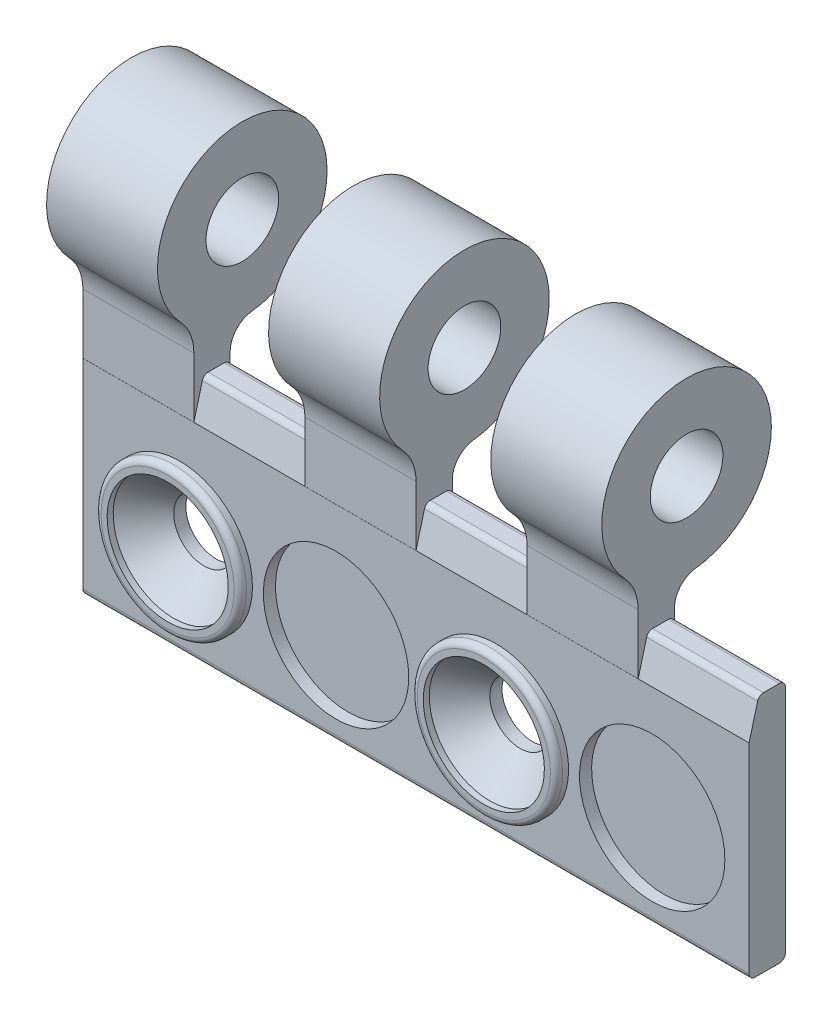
ISO-10303-21;
HEADER;
FILE_DESCRIPTION(('STEP AP214'),'2;1');
FILE_NAME('part.step','',(''),(''),'','','');
FILE_SCHEMA(('AUTOMOTIVE_DESIGN { 1 0 10303 214 1 1 1 1 }'));
ENDSEC;
DATA;
#1=APPLICATION_CONTEXT('core data for automotive mechanical design processes');
#2=APPLICATION_PROTOCOL_DEFINITION('international standard','automotive_design',2000,#1);
#3=PRODUCT_CONTEXT('',#1,'mechanical');
#4=PRODUCT('Part','Part','',(#3));
#5=PRODUCT_RELATED_PRODUCT_CATEGORY('part','',(#4));
#6=PRODUCT_DEFINITION_FORMATION('','',#4);
#7=PRODUCT_DEFINITION_CONTEXT('part definition',#1,'design');
#8=PRODUCT_DEFINITION('design','',#6,#7);
#9=PRODUCT_DEFINITION_SHAPE('','',#8);
#10=(LENGTH_UNIT() NAMED_UNIT(*) SI_UNIT(.MILLI.,.METRE.));
#11=(NAMED_UNIT(*) PLANE_ANGLE_UNIT() SI_UNIT($,.RADIAN.));
#12=(NAMED_UNIT(*) SI_UNIT($,.STERADIAN.) SOLID_ANGLE_UNIT());
#13=UNCERTAINTY_MEASURE_WITH_UNIT(LENGTH_MEASURE(1.E-05),#10,'distance_accuracy_value','');
#14=(GEOMETRIC_REPRESENTATION_CONTEXT(3) GLOBAL_UNCERTAINTY_ASSIGNED_CONTEXT((#13)) GLOBAL_UNIT_ASSIGNED_CONTEXT((#10,
#11,#12)) REPRESENTATION_CONTEXT('',''));
#15=CARTESIAN_POINT('',(0.,0.,0.));
#16=DIRECTION('',(0.,0.,1.));
#17=DIRECTION('',(1.,0.,0.));
#18=AXIS2_PLACEMENT_3D('',#15,#16,#17);
#19=CARTESIAN_POINT('',(-8.,11.85,0.49999999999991));
#20=DIRECTION('',(1.,0.,0.));
#21=DIRECTION('',(0.,1.,0.));
#22=AXIS2_PLACEMENT_3D('',#19,#20,#21);
#23=CYLINDRICAL_SURFACE('',#22,0.499999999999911);
#24=DIRECTION('',(1.,0.,0.));
#25=VECTOR('',#24,1.);
#26=CARTESIAN_POINT('',(-8.,11.85,0.));
#27=LINE('',#26,#25);
#28=CARTESIAN_POINT('',(1.16,11.85,0.));
#29=VERTEX_POINT('',#28);
#30=CARTESIAN_POINT('',(10.33,11.85,0.));
#31=VERTEX_POINT('',#30);
#32=EDGE_CURVE('E493',#29,#31,#27,.T.);
#33=ORIENTED_EDGE('',*,*,#32,.F.);
#34=CARTESIAN_POINT('',(1.16,11.85,0.49999999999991));
#35=DIRECTION('',(-1.,0.,0.));
#36=DIRECTION('',(0.,-1.,0.));
#37=AXIS2_PLACEMENT_3D('',#34,#35,#36);
#38=CIRCLE('',#37,0.499999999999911);
#39=CARTESIAN_POINT('',(1.16,12.35,0.5));
#40=VERTEX_POINT('',#39);
#41=EDGE_CURVE('E262',#29,#40,#38,.F.);
#42=ORIENTED_EDGE('',*,*,#41,.T.);
#43=DIRECTION('',(1.,0.,0.));
#44=VECTOR('',#43,1.);
#45=CARTESIAN_POINT('',(-8.,12.35,0.5));
#46=LINE('',#45,#44);
#47=CARTESIAN_POINT('',(10.33,12.35,0.5));
#48=VERTEX_POINT('',#47);
#49=EDGE_CURVE('E489',#40,#48,#46,.T.);
#50=ORIENTED_EDGE('',*,*,#49,.T.);
#51=CARTESIAN_POINT('',(10.33,11.85,0.49999999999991));
#52=DIRECTION('',(-1.,0.,0.));
#53=DIRECTION('',(0.,-1.,0.));
#54=AXIS2_PLACEMENT_3D('',#51,#52,#53);
#55=CIRCLE('',#54,0.499999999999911);
#56=EDGE_CURVE('E391',#31,#48,#55,.F.);
#57=ORIENTED_EDGE('',*,*,#56,.F.);
#58=EDGE_LOOP('',(#33,#42,#50,#57));
#59=FACE_BOUND('',#58,.T.);
#60=ADVANCED_FACE('F14',(#59),#23,.T.);
#61=CARTESIAN_POINT('',(-8.,12.35,0.5));
#62=DIRECTION('',(0.,1.,0.));
#63=DIRECTION('',(-1.,0.,0.));
#64=AXIS2_PLACEMENT_3D('',#61,#62,#63);
#65=PLANE('',#64);
#66=ORIENTED_EDGE('',*,*,#49,.F.);
#67=DIRECTION('',(0.,0.,1.));
#68=VECTOR('',#67,1.);
#69=CARTESIAN_POINT('',(1.16,12.35,0.5));
#70=LINE('',#69,#68);
#71=CARTESIAN_POINT('',(1.16,12.35,1.8124889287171));
#72=VERTEX_POINT('',#71);
#73=EDGE_CURVE('E254',#40,#72,#70,.T.);
#74=ORIENTED_EDGE('',*,*,#73,.T.);
#75=DIRECTION('',(1.,0.,0.));
#76=VECTOR('',#75,1.);
#77=CARTESIAN_POINT('',(-8.,12.35,1.8124889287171));
#78=LINE('',#77,#76);
#79=CARTESIAN_POINT('',(10.33,12.35,1.8124889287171));
#80=VERTEX_POINT('',#79);
#81=EDGE_CURVE('E485',#72,#80,#78,.T.);
#82=ORIENTED_EDGE('',*,*,#81,.T.);
#83=DIRECTION('',(0.,0.,1.));
#84=VECTOR('',#83,1.);
#85=CARTESIAN_POINT('',(10.33,12.35,0.5));
#86=LINE('',#85,#84);
#87=EDGE_CURVE('E388',#48,#80,#86,.T.);
#88=ORIENTED_EDGE('',*,*,#87,.F.);
#89=EDGE_LOOP('',(#66,#74,#82,#88));
#90=FACE_BOUND('',#89,.T.);
#91=ADVANCED_FACE('F605',(#90),#65,.T.);
#92=CARTESIAN_POINT('',(-8.,11.8499999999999,1.81248892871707));
#93=DIRECTION('',(1.,0.,0.));
#94=DIRECTION('',(0.,1.,0.));
#95=AXIS2_PLACEMENT_3D('',#92,#93,#94);
#96=CYLINDRICAL_SURFACE('',#95,0.500000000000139);
#97=ORIENTED_EDGE('',*,*,#81,.F.);
#98=CARTESIAN_POINT('',(1.16,11.8499999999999,1.81248892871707));
#99=DIRECTION('',(-1.,0.,0.));
#100=DIRECTION('',(0.,-1.,0.));
#101=AXIS2_PLACEMENT_3D('',#98,#99,#100);
#102=CIRCLE('',#101,0.500000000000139);
#103=CARTESIAN_POINT('',(1.16,11.9794095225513,2.2954518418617));
#104=VERTEX_POINT('',#103);
#105=EDGE_CURVE('E9',#72,#104,#102,.F.);
#106=ORIENTED_EDGE('',*,*,#105,.T.);
#107=DIRECTION('',(1.,0.,0.));
#108=VECTOR('',#107,1.);
#109=CARTESIAN_POINT('',(-8.,11.9794095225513,2.2954518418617));
#110=LINE('',#109,#108);
#111=CARTESIAN_POINT('',(10.33,11.9794095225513,2.2954518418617));
#112=VERTEX_POINT('',#111);
#113=EDGE_CURVE('E481',#104,#112,#110,.T.);
#114=ORIENTED_EDGE('',*,*,#113,.T.);
#115=CARTESIAN_POINT('',(10.33,11.8499999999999,1.81248892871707));
#116=DIRECTION('',(-1.,0.,0.));
#117=DIRECTION('',(0.,-1.,0.));
#118=AXIS2_PLACEMENT_3D('',#115,#116,#117);
#119=CIRCLE('',#118,0.500000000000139);
#120=EDGE_CURVE('E385',#80,#112,#119,.F.);
#121=ORIENTED_EDGE('',*,*,#120,.F.);
#122=EDGE_LOOP('',(#97,#106,#114,#121));
#123=FACE_BOUND('',#122,.T.);
#124=ADVANCED_FACE('F614',(#123),#96,.T.);
#125=CARTESIAN_POINT('',(37.84,11.85,0.));
#126=VERTEX_POINT('',#125);
#127=CARTESIAN_POINT('',(47.,11.85,0.));
#128=VERTEX_POINT('',#127);
#129=EDGE_CURVE('E491',#126,#128,#27,.T.);
#130=ORIENTED_EDGE('',*,*,#129,.F.);
#131=CARTESIAN_POINT('',(37.84,11.85,0.49999999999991));
#132=DIRECTION('',(-1.,0.,0.));
#133=DIRECTION('',(0.,-1.,0.));
#134=AXIS2_PLACEMENT_3D('',#131,#132,#133);
#135=CIRCLE('',#134,0.499999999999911);
#136=CARTESIAN_POINT('',(37.84,12.35,0.5));
#137=VERTEX_POINT('',#136);
#138=EDGE_CURVE('E38',#126,#137,#135,.F.);
#139=ORIENTED_EDGE('',*,*,#138,.T.);
#140=CARTESIAN_POINT('',(47.,12.35,0.5));
#141=VERTEX_POINT('',#140);
#142=EDGE_CURVE('E487',#137,#141,#46,.T.);
#143=ORIENTED_EDGE('',*,*,#142,.T.);
#144=CARTESIAN_POINT('',(47.,11.85,0.49999999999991));
#145=DIRECTION('',(1.,0.,0.));
#146=DIRECTION('',(0.,-1.,0.));
#147=AXIS2_PLACEMENT_3D('',#144,#145,#146);
#148=CIRCLE('',#147,0.499999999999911);
#149=EDGE_CURVE('E443',#128,#141,#148,.T.);
#150=ORIENTED_EDGE('',*,*,#149,.F.);
#151=EDGE_LOOP('',(#130,#139,#143,#150));
#152=FACE_BOUND('',#151,.T.);
#153=ADVANCED_FACE('F608',(#152),#23,.T.);
#154=ORIENTED_EDGE('',*,*,#142,.F.);
#155=DIRECTION('',(0.,0.,1.));
#156=VECTOR('',#155,1.);
#157=CARTESIAN_POINT('',(37.84,12.35,0.5));
#158=LINE('',#157,#156);
#159=CARTESIAN_POINT('',(37.84,12.35,1.8124889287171));
#160=VERTEX_POINT('',#159);
#161=EDGE_CURVE('E325',#137,#160,#158,.T.);
#162=ORIENTED_EDGE('',*,*,#161,.T.);
#163=CARTESIAN_POINT('',(47.,12.35,1.8124889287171));
#164=VERTEX_POINT('',#163);
#165=EDGE_CURVE('E483',#160,#164,#78,.T.);
#166=ORIENTED_EDGE('',*,*,#165,.T.);
#167=DIRECTION('',(0.,0.,1.));
#168=VECTOR('',#167,1.);
#169=CARTESIAN_POINT('',(47.,12.35,0.5));
#170=LINE('',#169,#168);
#171=EDGE_CURVE('E446',#141,#164,#170,.T.);
#172=ORIENTED_EDGE('',*,*,#171,.F.);
#173=EDGE_LOOP('',(#154,#162,#166,#172));
#174=FACE_BOUND('',#173,.T.);
#175=ADVANCED_FACE('F617',(#174),#65,.T.);
#176=ORIENTED_EDGE('',*,*,#165,.F.);
#177=CARTESIAN_POINT('',(37.84,11.8499999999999,1.81248892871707));
#178=DIRECTION('',(-1.,0.,0.));
#179=DIRECTION('',(0.,-1.,0.));
#180=AXIS2_PLACEMENT_3D('',#177,#178,#179);
#181=CIRCLE('',#180,0.500000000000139);
#182=CARTESIAN_POINT('',(37.84,11.9794095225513,2.2954518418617));
#183=VERTEX_POINT('',#182);
#184=EDGE_CURVE('E323',#160,#183,#181,.F.);
#185=ORIENTED_EDGE('',*,*,#184,.T.);
#186=CARTESIAN_POINT('',(47.,11.9794095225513,2.2954518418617));
#187=VERTEX_POINT('',#186);
#188=EDGE_CURVE('E480',#183,#187,#110,.T.);
#189=ORIENTED_EDGE('',*,*,#188,.T.);
#190=CARTESIAN_POINT('',(47.,11.8499999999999,1.81248892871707));
#191=DIRECTION('',(1.,0.,0.));
#192=DIRECTION('',(0.,1.,0.));
#193=AXIS2_PLACEMENT_3D('',#190,#191,#192);
#194=CIRCLE('',#193,0.500000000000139);
#195=EDGE_CURVE('E449',#164,#187,#194,.T.);
#196=ORIENTED_EDGE('',*,*,#195,.F.);
#197=EDGE_LOOP('',(#176,#185,#189,#196));
#198=FACE_BOUND('',#197,.T.);
#199=ADVANCED_FACE('F560',(#198),#96,.T.);
#200=CARTESIAN_POINT('',(-8.,11.9794095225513,2.2954518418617));
#201=DIRECTION('',(0.,0.258819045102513,0.965925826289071));
#202=DIRECTION('',(0.,-0.965925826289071,0.258819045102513));
#203=AXIS2_PLACEMENT_3D('',#200,#201,#202);
#204=PLANE('',#203);
#205=DIRECTION('',(1.,0.,0.));
#206=VECTOR('',#205,1.);
#207=CARTESIAN_POINT('',(-8.,9.35373205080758,2.999));
#208=LINE('',#207,#206);
#209=CARTESIAN_POINT('',(-8.,9.35373205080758,2.999));
#210=VERTEX_POINT('',#209);
#211=CARTESIAN_POINT('',(1.16,9.35373205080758,2.999));
#212=VERTEX_POINT('',#211);
#213=EDGE_CURVE('E251',#210,#212,#208,.T.);
#214=ORIENTED_EDGE('',*,*,#213,.F.);
#215=DIRECTION('',(0.,-0.965925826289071,0.258819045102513));
#216=VECTOR('',#215,1.);
#217=CARTESIAN_POINT('',(-8.,11.9794095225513,2.2954518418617));
#218=LINE('',#217,#216);
#219=CARTESIAN_POINT('',(-8.,9.35,3.));
#220=VERTEX_POINT('',#219);
#221=EDGE_CURVE('E235',#210,#220,#218,.T.);
#222=ORIENTED_EDGE('',*,*,#221,.T.);
#223=DIRECTION('',(1.,0.,0.));
#224=VECTOR('',#223,1.);
#225=CARTESIAN_POINT('',(-8.,9.35,3.));
#226=LINE('',#225,#224);
#227=CARTESIAN_POINT('',(47.,9.35,3.));
#228=VERTEX_POINT('',#227);
#229=EDGE_CURVE('E478',#220,#228,#226,.T.);
#230=ORIENTED_EDGE('',*,*,#229,.T.);
#231=DIRECTION('',(0.,-0.965925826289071,0.258819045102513));
#232=VECTOR('',#231,1.);
#233=CARTESIAN_POINT('',(47.,11.9794095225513,2.2954518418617));
#234=LINE('',#233,#232);
#235=EDGE_CURVE('E452',#187,#228,#234,.T.);
#236=ORIENTED_EDGE('',*,*,#235,.F.);
#237=ORIENTED_EDGE('',*,*,#188,.F.);
#238=DIRECTION('',(0.,-0.965925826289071,0.258819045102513));
#239=VECTOR('',#238,1.);
#240=CARTESIAN_POINT('',(37.84,11.9794095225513,2.2954518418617));
#241=LINE('',#240,#239);
#242=CARTESIAN_POINT('',(37.84,9.35373205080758,2.999));
#243=VERTEX_POINT('',#242);
#244=EDGE_CURVE('E23',#183,#243,#241,.T.);
#245=ORIENTED_EDGE('',*,*,#244,.T.);
#246=DIRECTION('',(-1.,0.,0.));
#247=VECTOR('',#246,1.);
#248=CARTESIAN_POINT('',(-8.,9.35373205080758,2.999));
#249=LINE('',#248,#247);
#250=CARTESIAN_POINT('',(28.67,9.35373205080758,2.999));
#251=VERTEX_POINT('',#250);
#252=EDGE_CURVE('E522',#243,#251,#249,.T.);
#253=ORIENTED_EDGE('',*,*,#252,.T.);
#254=DIRECTION('',(0.,-0.965925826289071,0.258819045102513));
#255=VECTOR('',#254,1.);
#256=CARTESIAN_POINT('',(28.67,11.9794095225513,2.2954518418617));
#257=LINE('',#256,#255);
#258=CARTESIAN_POINT('',(28.67,11.9794095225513,2.2954518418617));
#259=VERTEX_POINT('',#258);
#260=EDGE_CURVE('E519',#259,#251,#257,.T.);
#261=ORIENTED_EDGE('',*,*,#260,.F.);
#262=CARTESIAN_POINT('',(19.5,11.9794095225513,2.2954518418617));
#263=VERTEX_POINT('',#262);
#264=EDGE_CURVE('E484',#263,#259,#110,.T.);
#265=ORIENTED_EDGE('',*,*,#264,.F.);
#266=DIRECTION('',(0.,-0.965925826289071,0.258819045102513));
#267=VECTOR('',#266,1.);
#268=CARTESIAN_POINT('',(19.5,11.9794095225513,2.2954518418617));
#269=LINE('',#268,#267);
#270=CARTESIAN_POINT('',(19.5,9.35373205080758,2.999));
#271=VERTEX_POINT('',#270);
#272=EDGE_CURVE('E511',#263,#271,#269,.T.);
#273=ORIENTED_EDGE('',*,*,#272,.T.);
#274=DIRECTION('',(1.,0.,0.));
#275=VECTOR('',#274,1.);
#276=CARTESIAN_POINT('',(-8.,9.35373205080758,2.999));
#277=LINE('',#276,#275);
#278=CARTESIAN_POINT('',(10.33,9.35373205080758,2.999));
#279=VERTEX_POINT('',#278);
#280=EDGE_CURVE('E514',#279,#271,#277,.T.);
#281=ORIENTED_EDGE('',*,*,#280,.F.);
#282=DIRECTION('',(0.,-0.965925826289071,0.258819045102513));
#283=VECTOR('',#282,1.);
#284=CARTESIAN_POINT('',(10.33,11.9794095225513,2.2954518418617));
#285=LINE('',#284,#283);
#286=EDGE_CURVE('E517',#112,#279,#285,.T.);
#287=ORIENTED_EDGE('',*,*,#286,.F.);
#288=ORIENTED_EDGE('',*,*,#113,.F.);
#289=DIRECTION('',(0.,-0.965925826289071,0.258819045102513));
#290=VECTOR('',#289,1.);
#291=CARTESIAN_POINT('',(1.16,11.9794095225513,2.2954518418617));
#292=LINE('',#291,#290);
#293=EDGE_CURVE('E265',#104,#212,#292,.T.);
#294=ORIENTED_EDGE('',*,*,#293,.T.);
#295=EDGE_LOOP('',(#214,#222,#230,#236,#237,#245,#253,#261,#265,#273,#281,#287,#288,#294));
#296=FACE_BOUND('',#295,.T.);
#297=ADVANCED_FACE('F529',(#296),#204,.T.);
#298=CARTESIAN_POINT('',(28.67,11.85,0.49999999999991));
#299=DIRECTION('',(-1.,0.,0.));
#300=DIRECTION('',(0.,-1.,0.));
#301=AXIS2_PLACEMENT_3D('',#298,#299,#300);
#302=CIRCLE('',#301,0.499999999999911);
#303=CARTESIAN_POINT('',(28.67,11.85,0.));
#304=VERTEX_POINT('',#303);
#305=CARTESIAN_POINT('',(28.67,12.35,0.5));
#306=VERTEX_POINT('',#305);
#307=EDGE_CURVE('E320',#304,#306,#302,.F.);
#308=ORIENTED_EDGE('',*,*,#307,.F.);
#309=CARTESIAN_POINT('',(19.5,11.85,0.));
#310=VERTEX_POINT('',#309);
#311=EDGE_CURVE('E495',#310,#304,#27,.T.);
#312=ORIENTED_EDGE('',*,*,#311,.F.);
#313=CARTESIAN_POINT('',(19.5,11.85,0.49999999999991));
#314=DIRECTION('',(-1.,0.,0.));
#315=DIRECTION('',(0.,-1.,0.));
#316=AXIS2_PLACEMENT_3D('',#313,#314,#315);
#317=CIRCLE('',#316,0.499999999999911);
#318=CARTESIAN_POINT('',(19.5,12.35,0.5));
#319=VERTEX_POINT('',#318);
#320=EDGE_CURVE('E382',#310,#319,#317,.F.);
#321=ORIENTED_EDGE('',*,*,#320,.T.);
#322=EDGE_CURVE('E492',#319,#306,#46,.T.);
#323=ORIENTED_EDGE('',*,*,#322,.T.);
#324=EDGE_LOOP('',(#308,#312,#321,#323));
#325=FACE_BOUND('',#324,.T.);
#326=ADVANCED_FACE('F609',(#325),#23,.T.);
#327=DIRECTION('',(0.,0.,1.));
#328=VECTOR('',#327,1.);
#329=CARTESIAN_POINT('',(28.67,12.35,0.5));
#330=LINE('',#329,#328);
#331=CARTESIAN_POINT('',(28.67,12.35,1.8124889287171));
#332=VERTEX_POINT('',#331);
#333=EDGE_CURVE('E317',#306,#332,#330,.T.);
#334=ORIENTED_EDGE('',*,*,#333,.F.);
#335=ORIENTED_EDGE('',*,*,#322,.F.);
#336=DIRECTION('',(0.,0.,1.));
#337=VECTOR('',#336,1.);
#338=CARTESIAN_POINT('',(19.5,12.35,0.5));
#339=LINE('',#338,#337);
#340=CARTESIAN_POINT('',(19.5,12.35,1.8124889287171));
#341=VERTEX_POINT('',#340);
#342=EDGE_CURVE('E379',#319,#341,#339,.T.);
#343=ORIENTED_EDGE('',*,*,#342,.T.);
#344=EDGE_CURVE('E488',#341,#332,#78,.T.);
#345=ORIENTED_EDGE('',*,*,#344,.T.);
#346=EDGE_LOOP('',(#334,#335,#343,#345));
#347=FACE_BOUND('',#346,.T.);
#348=ADVANCED_FACE('F618',(#347),#65,.T.);
#349=CARTESIAN_POINT('',(28.67,11.8499999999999,1.81248892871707));
#350=DIRECTION('',(-1.,0.,0.));
#351=DIRECTION('',(0.,-1.,0.));
#352=AXIS2_PLACEMENT_3D('',#349,#350,#351);
#353=CIRCLE('',#352,0.500000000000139);
#354=EDGE_CURVE('E314',#332,#259,#353,.F.);
#355=ORIENTED_EDGE('',*,*,#354,.F.);
#356=ORIENTED_EDGE('',*,*,#344,.F.);
#357=CARTESIAN_POINT('',(19.5,11.8499999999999,1.81248892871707));
#358=DIRECTION('',(-1.,0.,0.));
#359=DIRECTION('',(0.,-1.,0.));
#360=AXIS2_PLACEMENT_3D('',#357,#358,#359);
#361=CIRCLE('',#360,0.500000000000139);
#362=EDGE_CURVE('E376',#341,#263,#361,.F.);
#363=ORIENTED_EDGE('',*,*,#362,.T.);
#364=ORIENTED_EDGE('',*,*,#264,.T.);
#365=EDGE_LOOP('',(#355,#356,#363,#364));
#366=FACE_BOUND('',#365,.T.);
#367=ADVANCED_FACE('F554',(#366),#96,.T.);
#368=CARTESIAN_POINT('',(-8.,-7.65,2.5));
#369=DIRECTION('',(0.,-1.,0.));
#370=DIRECTION('',(1.,0.,0.));
#371=AXIS2_PLACEMENT_3D('',#368,#369,#370);
#372=PLANE('',#371);
#373=DIRECTION('',(1.,0.,0.));
#374=VECTOR('',#373,1.);
#375=CARTESIAN_POINT('',(-8.,-7.65,0.5));
#376=LINE('',#375,#374);
#377=CARTESIAN_POINT('',(-8.,-7.65,0.5));
#378=VERTEX_POINT('',#377);
#379=CARTESIAN_POINT('',(47.,-7.65,0.5));
#380=VERTEX_POINT('',#379);
#381=EDGE_CURVE('E497',#378,#380,#376,.T.);
#382=ORIENTED_EDGE('',*,*,#381,.T.);
#383=DIRECTION('',(0.,0.,-1.));
#384=VECTOR('',#383,1.);
#385=CARTESIAN_POINT('',(47.,-7.65,2.5));
#386=LINE('',#385,#384);
#387=CARTESIAN_POINT('',(47.,-7.65,2.5));
#388=VERTEX_POINT('',#387);
#389=EDGE_CURVE('E436',#388,#380,#386,.T.);
#390=ORIENTED_EDGE('',*,*,#389,.F.);
#391=DIRECTION('',(1.,0.,0.));
#392=VECTOR('',#391,1.);
#393=CARTESIAN_POINT('',(-8.,-7.65,2.5));
#394=LINE('',#393,#392);
#395=CARTESIAN_POINT('',(-8.,-7.65,2.5));
#396=VERTEX_POINT('',#395);
#397=EDGE_CURVE('E472',#396,#388,#394,.T.);
#398=ORIENTED_EDGE('',*,*,#397,.F.);
#399=DIRECTION('',(0.,0.,-1.));
#400=VECTOR('',#399,1.);
#401=CARTESIAN_POINT('',(-8.,-7.65,2.5));
#402=LINE('',#401,#400);
#403=EDGE_CURVE('E461',#396,#378,#402,.T.);
#404=ORIENTED_EDGE('',*,*,#403,.T.);
#405=EDGE_LOOP('',(#382,#390,#398,#404));
#406=FACE_BOUND('',#405,.T.);
#407=ADVANCED_FACE('F16',(#406),#372,.T.);
#408=CARTESIAN_POINT('',(-8.,-7.1499999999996,0.500000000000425));
#409=DIRECTION('',(1.,0.,0.));
#410=DIRECTION('',(0.,1.,0.));
#411=AXIS2_PLACEMENT_3D('',#408,#409,#410);
#412=CYLINDRICAL_SURFACE('',#411,0.500000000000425);
#413=DIRECTION('',(1.,0.,0.));
#414=VECTOR('',#413,1.);
#415=CARTESIAN_POINT('',(-8.,-7.15,0.));
#416=LINE('',#415,#414);
#417=CARTESIAN_POINT('',(-8.,-7.15,0.));
#418=VERTEX_POINT('',#417);
#419=CARTESIAN_POINT('',(47.,-7.15,0.));
#420=VERTEX_POINT('',#419);
#421=EDGE_CURVE('E232',#418,#420,#416,.T.);
#422=ORIENTED_EDGE('',*,*,#421,.T.);
#423=CARTESIAN_POINT('',(47.,-7.1499999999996,0.500000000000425));
#424=DIRECTION('',(1.,0.,0.));
#425=DIRECTION('',(0.,1.,0.));
#426=AXIS2_PLACEMENT_3D('',#423,#424,#425);
#427=CIRCLE('',#426,0.500000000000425);
#428=EDGE_CURVE('E437',#380,#420,#427,.T.);
#429=ORIENTED_EDGE('',*,*,#428,.F.);
#430=ORIENTED_EDGE('',*,*,#381,.F.);
#431=CARTESIAN_POINT('',(-8.,-7.1499999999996,0.500000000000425));
#432=DIRECTION('',(1.,0.,0.));
#433=DIRECTION('',(0.,1.,0.));
#434=AXIS2_PLACEMENT_3D('',#431,#432,#433);
#435=CIRCLE('',#434,0.500000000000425);
#436=EDGE_CURVE('E236',#378,#418,#435,.T.);
#437=ORIENTED_EDGE('',*,*,#436,.T.);
#438=EDGE_LOOP('',(#422,#429,#430,#437));
#439=FACE_BOUND('',#438,.T.);
#440=ADVANCED_FACE('F578',(#439),#412,.T.);
#441=CARTESIAN_POINT('',(-8.,-7.15,0.));
#442=DIRECTION('',(0.,0.,-1.));
#443=DIRECTION('',(-1.,0.,0.));
#444=AXIS2_PLACEMENT_3D('',#441,#442,#443);
#445=PLANE('',#444);
#446=DIRECTION('',(0.,1.,0.));
#447=VECTOR('',#446,1.);
#448=CARTESIAN_POINT('',(-8.,-7.15,0.));
#449=LINE('',#448,#447);
#450=CARTESIAN_POINT('',(-8.,12.9057280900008,0.));
#451=VERTEX_POINT('',#450);
#452=EDGE_CURVE('E223',#418,#451,#449,.T.);
#453=ORIENTED_EDGE('',*,*,#452,.T.);
#454=DIRECTION('',(1.,0.,0.));
#455=VECTOR('',#454,1.);
#456=CARTESIAN_POINT('',(-8.01,12.9057280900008,0.));
#457=LINE('',#456,#455);
#458=CARTESIAN_POINT('',(1.16,12.9057280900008,0.));
#459=VERTEX_POINT('',#458);
#460=EDGE_CURVE('E229',#451,#459,#457,.T.);
#461=ORIENTED_EDGE('',*,*,#460,.T.);
#462=DIRECTION('',(0.,1.,0.));
#463=VECTOR('',#462,1.);
#464=CARTESIAN_POINT('',(1.16,6.85,0.));
#465=LINE('',#464,#463);
#466=EDGE_CURVE('E667',#29,#459,#465,.T.);
#467=ORIENTED_EDGE('',*,*,#466,.F.);
#468=ORIENTED_EDGE('',*,*,#32,.T.);
#469=DIRECTION('',(0.,1.,0.));
#470=VECTOR('',#469,1.);
#471=CARTESIAN_POINT('',(10.33,6.85,0.));
#472=LINE('',#471,#470);
#473=CARTESIAN_POINT('',(10.33,12.9057280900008,0.));
#474=VERTEX_POINT('',#473);
#475=EDGE_CURVE('E351',#31,#474,#472,.T.);
#476=ORIENTED_EDGE('',*,*,#475,.T.);
#477=DIRECTION('',(1.,0.,0.));
#478=VECTOR('',#477,1.);
#479=CARTESIAN_POINT('',(10.33,12.9057280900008,0.));
#480=LINE('',#479,#478);
#481=CARTESIAN_POINT('',(19.5,12.9057280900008,0.));
#482=VERTEX_POINT('',#481);
#483=EDGE_CURVE('E373',#474,#482,#480,.T.);
#484=ORIENTED_EDGE('',*,*,#483,.T.);
#485=DIRECTION('',(0.,1.,0.));
#486=VECTOR('',#485,1.);
#487=CARTESIAN_POINT('',(19.5,6.85,0.));
#488=LINE('',#487,#486);
#489=EDGE_CURVE('E329',#310,#482,#488,.T.);
#490=ORIENTED_EDGE('',*,*,#489,.F.);
#491=ORIENTED_EDGE('',*,*,#311,.T.);
#492=DIRECTION('',(0.,1.,0.));
#493=VECTOR('',#492,1.);
#494=CARTESIAN_POINT('',(28.67,6.85,0.));
#495=LINE('',#494,#493);
#496=CARTESIAN_POINT('',(28.67,12.9057280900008,0.));
#497=VERTEX_POINT('',#496);
#498=EDGE_CURVE('E269',#304,#497,#495,.T.);
#499=ORIENTED_EDGE('',*,*,#498,.T.);
#500=DIRECTION('',(-1.,0.,0.));
#501=VECTOR('',#500,1.);
#502=CARTESIAN_POINT('',(37.84,12.9057280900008,0.));
#503=LINE('',#502,#501);
#504=CARTESIAN_POINT('',(37.84,12.9057280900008,0.));
#505=VERTEX_POINT('',#504);
#506=EDGE_CURVE('E311',#505,#497,#503,.T.);
#507=ORIENTED_EDGE('',*,*,#506,.F.);
#508=DIRECTION('',(0.,1.,0.));
#509=VECTOR('',#508,1.);
#510=CARTESIAN_POINT('',(37.84,6.85,0.));
#511=LINE('',#510,#509);
#512=EDGE_CURVE('E289',#126,#505,#511,.T.);
#513=ORIENTED_EDGE('',*,*,#512,.F.);
#514=ORIENTED_EDGE('',*,*,#129,.T.);
#515=DIRECTION('',(0.,1.,0.));
#516=VECTOR('',#515,1.);
#517=CARTESIAN_POINT('',(47.,-7.15,0.));
#518=LINE('',#517,#516);
#519=EDGE_CURVE('E440',#420,#128,#518,.T.);
#520=ORIENTED_EDGE('',*,*,#519,.F.);
#521=ORIENTED_EDGE('',*,*,#421,.F.);
#522=EDGE_LOOP('',(#453,#461,#467,#468,#476,#484,#490,#491,#499,#507,#513,#514,#520,#521));
#523=FACE_BOUND('',#522,.T.);
#524=CARTESIAN_POINT('',(0.,0.,0.));
#525=DIRECTION('',(0.,0.,1.));
#526=DIRECTION('',(0.,-1.,0.));
#527=AXIS2_PLACEMENT_3D('',#524,#525,#526);
#528=CIRCLE('',#527,2.5);
#529=CARTESIAN_POINT('',(0.,-2.5,0.));
#530=VERTEX_POINT('',#529);
#531=EDGE_CURVE('E406',#530,#530,#528,.T.);
#532=ORIENTED_EDGE('',*,*,#531,.T.);
#533=EDGE_LOOP('',(#532));
#534=FACE_BOUND('',#533,.T.);
#535=CARTESIAN_POINT('',(26.1,0.,0.));
#536=DIRECTION('',(0.,0.,1.));
#537=DIRECTION('',(0.,-1.,0.));
#538=AXIS2_PLACEMENT_3D('',#535,#536,#537);
#539=CIRCLE('',#538,2.5);
#540=CARTESIAN_POINT('',(26.1,-2.5,0.));
#541=VERTEX_POINT('',#540);
#542=EDGE_CURVE('E394',#541,#541,#539,.T.);
#543=ORIENTED_EDGE('',*,*,#542,.T.);
#544=EDGE_LOOP('',(#543));
#545=FACE_BOUND('',#544,.T.);
#546=ADVANCED_FACE('F225',(#523,#534,#545),#445,.T.);
#547=CARTESIAN_POINT('',(-8.,9.35,3.));
#548=DIRECTION('',(0.,0.,1.));
#549=DIRECTION('',(1.,0.,0.));
#550=AXIS2_PLACEMENT_3D('',#547,#548,#549);
#551=PLANE('',#550);
#552=CARTESIAN_POINT('',(12.9,0.,3.));
#553=DIRECTION('',(0.,0.,1.));
#554=DIRECTION('',(1.,0.,0.));
#555=AXIS2_PLACEMENT_3D('',#552,#553,#554);
#556=CIRCLE('',#555,6.);
#557=CARTESIAN_POINT('',(18.9,0.,3.));
#558=VERTEX_POINT('',#557);
#559=EDGE_CURVE('E508',#558,#558,#556,.T.);
#560=ORIENTED_EDGE('',*,*,#559,.F.);
#561=EDGE_LOOP('',(#560));
#562=FACE_BOUND('',#561,.T.);
#563=CARTESIAN_POINT('',(39.,0.,3.));
#564=DIRECTION('',(0.,0.,1.));
#565=DIRECTION('',(1.,0.,0.));
#566=AXIS2_PLACEMENT_3D('',#563,#564,#565);
#567=CIRCLE('',#566,6.);
#568=CARTESIAN_POINT('',(45.,0.,3.));
#569=VERTEX_POINT('',#568);
#570=EDGE_CURVE('E505',#569,#569,#567,.T.);
#571=ORIENTED_EDGE('',*,*,#570,.F.);
#572=EDGE_LOOP('',(#571));
#573=FACE_BOUND('',#572,.T.);
#574=CARTESIAN_POINT('',(26.1,0.,3.));
#575=DIRECTION('',(0.,0.,1.));
#576=DIRECTION('',(1.,0.,0.));
#577=AXIS2_PLACEMENT_3D('',#574,#575,#576);
#578=CIRCLE('',#577,6.);
#579=CARTESIAN_POINT('',(32.1,0.,3.));
#580=VERTEX_POINT('',#579);
#581=EDGE_CURVE('E502',#580,#580,#578,.T.);
#582=ORIENTED_EDGE('',*,*,#581,.F.);
#583=EDGE_LOOP('',(#582));
#584=FACE_BOUND('',#583,.T.);
#585=CARTESIAN_POINT('',(0.,0.,3.));
#586=DIRECTION('',(0.,0.,1.));
#587=DIRECTION('',(1.,0.,0.));
#588=AXIS2_PLACEMENT_3D('',#585,#586,#587);
#589=CIRCLE('',#588,6.);
#590=CARTESIAN_POINT('',(6.,0.,3.));
#591=VERTEX_POINT('',#590);
#592=EDGE_CURVE('E499',#591,#591,#589,.T.);
#593=ORIENTED_EDGE('',*,*,#592,.F.);
#594=EDGE_LOOP('',(#593));
#595=FACE_BOUND('',#594,.T.);
#596=DIRECTION('',(1.,0.,0.));
#597=VECTOR('',#596,1.);
#598=CARTESIAN_POINT('',(-8.,-7.15,3.));
#599=LINE('',#598,#597);
#600=CARTESIAN_POINT('',(-8.,-7.15,3.));
#601=VERTEX_POINT('',#600);
#602=CARTESIAN_POINT('',(47.,-7.15,3.));
#603=VERTEX_POINT('',#602);
#604=EDGE_CURVE('E476',#601,#603,#599,.T.);
#605=ORIENTED_EDGE('',*,*,#604,.T.);
#606=DIRECTION('',(0.,-1.,0.));
#607=VECTOR('',#606,1.);
#608=CARTESIAN_POINT('',(47.,9.35,3.));
#609=LINE('',#608,#607);
#610=EDGE_CURVE('E455',#228,#603,#609,.T.);
#611=ORIENTED_EDGE('',*,*,#610,.F.);
#612=ORIENTED_EDGE('',*,*,#229,.F.);
#613=DIRECTION('',(0.,-1.,0.));
#614=VECTOR('',#613,1.);
#615=CARTESIAN_POINT('',(-8.,9.35,3.));
#616=LINE('',#615,#614);
#617=EDGE_CURVE('E466',#220,#601,#616,.T.);
#618=ORIENTED_EDGE('',*,*,#617,.T.);
#619=EDGE_LOOP('',(#605,#611,#612,#618));
#620=FACE_BOUND('',#619,.T.);
#621=ADVANCED_FACE('F568',(#562,#573,#584,#595,#620),#551,.T.);
#622=CARTESIAN_POINT('',(-8.,-7.1499999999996,2.49999999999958));
#623=DIRECTION('',(1.,0.,0.));
#624=DIRECTION('',(0.,1.,0.));
#625=AXIS2_PLACEMENT_3D('',#622,#623,#624);
#626=CYLINDRICAL_SURFACE('',#625,0.500000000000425);
#627=ORIENTED_EDGE('',*,*,#397,.T.);
#628=CARTESIAN_POINT('',(47.,-7.1499999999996,2.49999999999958));
#629=DIRECTION('',(1.,0.,0.));
#630=DIRECTION('',(0.,1.,0.));
#631=AXIS2_PLACEMENT_3D('',#628,#629,#630);
#632=CIRCLE('',#631,0.500000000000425);
#633=EDGE_CURVE('E458',#603,#388,#632,.T.);
#634=ORIENTED_EDGE('',*,*,#633,.F.);
#635=ORIENTED_EDGE('',*,*,#604,.F.);
#636=CARTESIAN_POINT('',(-8.,-7.1499999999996,2.49999999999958));
#637=DIRECTION('',(1.,0.,0.));
#638=DIRECTION('',(0.,1.,0.));
#639=AXIS2_PLACEMENT_3D('',#636,#637,#638);
#640=CIRCLE('',#639,0.500000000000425);
#641=EDGE_CURVE('E469',#601,#396,#640,.T.);
#642=ORIENTED_EDGE('',*,*,#641,.T.);
#643=EDGE_LOOP('',(#627,#634,#635,#642));
#644=FACE_BOUND('',#643,.T.);
#645=ADVANCED_FACE('F572',(#644),#626,.T.);
#646=CARTESIAN_POINT('',(-8.,-7.1499999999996,0.500000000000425));
#647=DIRECTION('',(1.,0.,0.));
#648=DIRECTION('',(0.,1.,0.));
#649=AXIS2_PLACEMENT_3D('',#646,#647,#648);
#650=PLANE('',#649);
#651=CARTESIAN_POINT('',(-8.,12.9057280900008,-2.00000000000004));
#652=DIRECTION('',(1.,0.,0.));
#653=DIRECTION('',(0.,0.,-1.));
#654=AXIS2_PLACEMENT_3D('',#651,#652,#653);
#655=CIRCLE('',#654,2.00000000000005);
#656=CARTESIAN_POINT('',(-8.,14.8933440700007,-1.77777777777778));
#657=VERTEX_POINT('',#656);
#658=EDGE_CURVE('E239',#657,#451,#655,.T.);
#659=ORIENTED_EDGE('',*,*,#658,.T.);
#660=ORIENTED_EDGE('',*,*,#452,.F.);
#661=ORIENTED_EDGE('',*,*,#436,.F.);
#662=ORIENTED_EDGE('',*,*,#403,.F.);
#663=ORIENTED_EDGE('',*,*,#641,.F.);
#664=ORIENTED_EDGE('',*,*,#617,.F.);
#665=ORIENTED_EDGE('',*,*,#221,.F.);
#666=DIRECTION('',(0.,1.,0.));
#667=VECTOR('',#666,1.);
#668=CARTESIAN_POINT('',(-8.,6.85,2.999));
#669=LINE('',#668,#667);
#670=CARTESIAN_POINT('',(-8.,14.2991060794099,2.999));
#671=VERTEX_POINT('',#670);
#672=EDGE_CURVE('E30',#210,#671,#669,.T.);
#673=ORIENTED_EDGE('',*,*,#672,.T.);
#674=CARTESIAN_POINT('',(-8.,14.2991060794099,6.99900000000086));
#675=DIRECTION('',(1.,0.,0.));
#676=DIRECTION('',(0.,0.,-1.));
#677=AXIS2_PLACEMENT_3D('',#674,#675,#676);
#678=CIRCLE('',#677,4.00000000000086);
#679=CARTESIAN_POINT('',(-8.,17.0448856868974,4.0902727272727));
#680=VERTEX_POINT('',#679);
#681=EDGE_CURVE('E695',#671,#680,#678,.T.);
#682=ORIENTED_EDGE('',*,*,#681,.T.);
#683=CARTESIAN_POINT('',(-8.,21.85,-0.999999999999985));
#684=DIRECTION('',(1.,0.,0.));
#685=DIRECTION('',(0.,0.,-1.));
#686=AXIS2_PLACEMENT_3D('',#683,#684,#685);
#687=CIRCLE('',#686,7.);
#688=EDGE_CURVE('E243',#680,#657,#687,.F.);
#689=ORIENTED_EDGE('',*,*,#688,.T.);
#690=EDGE_LOOP('',(#659,#660,#661,#662,#663,#664,#665,#673,#682,#689));
#691=FACE_BOUND('',#690,.T.);
#692=CARTESIAN_POINT('',(-8.,21.85,-1.));
#693=DIRECTION('',(1.,0.,0.));
#694=DIRECTION('',(0.,0.,-1.));
#695=AXIS2_PLACEMENT_3D('',#692,#693,#694);
#696=CIRCLE('',#695,3.);
#697=CARTESIAN_POINT('',(-8.,21.85,-4.));
#698=VERTEX_POINT('',#697);
#699=EDGE_CURVE('E18',#698,#698,#696,.F.);
#700=ORIENTED_EDGE('',*,*,#699,.F.);
#701=EDGE_LOOP('',(#700));
#702=FACE_BOUND('',#701,.T.);
#703=ADVANCED_FACE('F240',(#691,#702),#650,.F.);
#704=CARTESIAN_POINT('',(47.,-7.1499999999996,0.500000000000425));
#705=DIRECTION('',(1.,0.,0.));
#706=DIRECTION('',(0.,1.,0.));
#707=AXIS2_PLACEMENT_3D('',#704,#705,#706);
#708=PLANE('',#707);
#709=ORIENTED_EDGE('',*,*,#389,.T.);
#710=ORIENTED_EDGE('',*,*,#428,.T.);
#711=ORIENTED_EDGE('',*,*,#519,.T.);
#712=ORIENTED_EDGE('',*,*,#149,.T.);
#713=ORIENTED_EDGE('',*,*,#171,.T.);
#714=ORIENTED_EDGE('',*,*,#195,.T.);
#715=ORIENTED_EDGE('',*,*,#235,.T.);
#716=ORIENTED_EDGE('',*,*,#610,.T.);
#717=ORIENTED_EDGE('',*,*,#633,.T.);
#718=EDGE_LOOP('',(#709,#710,#711,#712,#713,#714,#715,#716,#717));
#719=FACE_BOUND('',#718,.T.);
#720=ADVANCED_FACE('F562',(#719),#708,.T.);
#721=CARTESIAN_POINT('',(0.,0.,4.));
#722=DIRECTION('',(0.,0.,1.));
#723=DIRECTION('',(0.,-1.,0.));
#724=AXIS2_PLACEMENT_3D('',#721,#722,#723);
#725=PLANE('',#724);
#726=CARTESIAN_POINT('',(0.,0.,4.));
#727=DIRECTION('',(0.,0.,1.));
#728=DIRECTION('',(0.,-1.,0.));
#729=AXIS2_PLACEMENT_3D('',#726,#727,#728);
#730=CIRCLE('',#729,5.);
#731=CARTESIAN_POINT('',(0.,-5.,4.));
#732=VERTEX_POINT('',#731);
#733=EDGE_CURVE('E415',#732,#732,#730,.T.);
#734=ORIENTED_EDGE('',*,*,#733,.F.);
#735=EDGE_LOOP('',(#734));
#736=FACE_BOUND('',#735,.T.);
#737=CARTESIAN_POINT('',(0.,0.,4.));
#738=DIRECTION('',(0.,0.,1.));
#739=DIRECTION('',(0.,-1.,0.));
#740=AXIS2_PLACEMENT_3D('',#737,#738,#739);
#741=CIRCLE('',#740,5.5);
#742=CARTESIAN_POINT('',(0.,-5.5,4.));
#743=VERTEX_POINT('',#742);
#744=EDGE_CURVE('E433',#743,#743,#741,.T.);
#745=ORIENTED_EDGE('',*,*,#744,.T.);
#746=EDGE_LOOP('',(#745));
#747=FACE_BOUND('',#746,.T.);
#748=ADVANCED_FACE('F1042',(#736,#747),#725,.T.);
#749=CARTESIAN_POINT('',(0.,0.,3.49999999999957));
#750=DIRECTION('',(0.,0.,1.));
#751=DIRECTION('',(0.,-1.,0.));
#752=AXIS2_PLACEMENT_3D('',#749,#750,#751);
#753=TOROIDAL_SURFACE('',#752,5.49999999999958,0.500000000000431);
#754=CARTESIAN_POINT('',(0.,0.,3.5));
#755=DIRECTION('',(0.,0.,1.));
#756=DIRECTION('',(0.,-1.,0.));
#757=AXIS2_PLACEMENT_3D('',#754,#755,#756);
#758=CIRCLE('',#757,6.);
#759=CARTESIAN_POINT('',(0.,-6.,3.5));
#760=VERTEX_POINT('',#759);
#761=EDGE_CURVE('E430',#760,#760,#758,.T.);
#762=ORIENTED_EDGE('',*,*,#761,.T.);
#763=EDGE_LOOP('',(#762));
#764=FACE_BOUND('',#763,.T.);
#765=ORIENTED_EDGE('',*,*,#744,.F.);
#766=EDGE_LOOP('',(#765));
#767=FACE_BOUND('',#766,.T.);
#768=ADVANCED_FACE('F1031',(#764,#767),#753,.T.);
#769=CARTESIAN_POINT('',(0.,0.,1.5));
#770=DIRECTION('',(0.,0.,1.));
#771=DIRECTION('',(0.,-1.,0.));
#772=AXIS2_PLACEMENT_3D('',#769,#770,#771);
#773=CYLINDRICAL_SURFACE('',#772,6.);
#774=ORIENTED_EDGE('',*,*,#592,.T.);
#775=EDGE_LOOP('',(#774));
#776=FACE_BOUND('',#775,.T.);
#777=ORIENTED_EDGE('',*,*,#761,.F.);
#778=EDGE_LOOP('',(#777));
#779=FACE_BOUND('',#778,.T.);
#780=ADVANCED_FACE('F1020',(#776,#779),#773,.T.);
#781=CARTESIAN_POINT('',(26.1,0.,4.));
#782=DIRECTION('',(0.,0.,1.));
#783=DIRECTION('',(0.,-1.,0.));
#784=AXIS2_PLACEMENT_3D('',#781,#782,#783);
#785=PLANE('',#784);
#786=CARTESIAN_POINT('',(26.1,0.,4.));
#787=DIRECTION('',(0.,0.,1.));
#788=DIRECTION('',(0.,-1.,0.));
#789=AXIS2_PLACEMENT_3D('',#786,#787,#788);
#790=CIRCLE('',#789,5.);
#791=CARTESIAN_POINT('',(26.1,-5.,4.));
#792=VERTEX_POINT('',#791);
#793=EDGE_CURVE('E403',#792,#792,#790,.T.);
#794=ORIENTED_EDGE('',*,*,#793,.F.);
#795=EDGE_LOOP('',(#794));
#796=FACE_BOUND('',#795,.T.);
#797=CARTESIAN_POINT('',(26.1,0.,4.));
#798=DIRECTION('',(0.,0.,1.));
#799=DIRECTION('',(0.,-1.,0.));
#800=AXIS2_PLACEMENT_3D('',#797,#798,#799);
#801=CIRCLE('',#800,5.5);
#802=CARTESIAN_POINT('',(26.1,-5.5,4.));
#803=VERTEX_POINT('',#802);
#804=EDGE_CURVE('E427',#803,#803,#801,.T.);
#805=ORIENTED_EDGE('',*,*,#804,.T.);
#806=EDGE_LOOP('',(#805));
#807=FACE_BOUND('',#806,.T.);
#808=ADVANCED_FACE('F1009',(#796,#807),#785,.T.);
#809=CARTESIAN_POINT('',(26.1,0.,3.5));
#810=DIRECTION('',(0.,0.,1.));
#811=DIRECTION('',(0.,-1.,0.));
#812=AXIS2_PLACEMENT_3D('',#809,#810,#811);
#813=TOROIDAL_SURFACE('',#812,5.5,0.499999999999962);
#814=CARTESIAN_POINT('',(26.1,0.,3.5));
#815=DIRECTION('',(0.,0.,1.));
#816=DIRECTION('',(0.,-1.,0.));
#817=AXIS2_PLACEMENT_3D('',#814,#815,#816);
#818=CIRCLE('',#817,6.);
#819=CARTESIAN_POINT('',(26.1,-6.,3.5));
#820=VERTEX_POINT('',#819);
#821=EDGE_CURVE('E424',#820,#820,#818,.T.);
#822=ORIENTED_EDGE('',*,*,#821,.T.);
#823=EDGE_LOOP('',(#822));
#824=FACE_BOUND('',#823,.T.);
#825=ORIENTED_EDGE('',*,*,#804,.F.);
#826=EDGE_LOOP('',(#825));
#827=FACE_BOUND('',#826,.T.);
#828=ADVANCED_FACE('F998',(#824,#827),#813,.T.);
#829=CARTESIAN_POINT('',(26.1,0.,1.5));
#830=DIRECTION('',(0.,0.,1.));
#831=DIRECTION('',(0.,-1.,0.));
#832=AXIS2_PLACEMENT_3D('',#829,#830,#831);
#833=CYLINDRICAL_SURFACE('',#832,6.);
#834=ORIENTED_EDGE('',*,*,#581,.T.);
#835=EDGE_LOOP('',(#834));
#836=FACE_BOUND('',#835,.T.);
#837=ORIENTED_EDGE('',*,*,#821,.F.);
#838=EDGE_LOOP('',(#837));
#839=FACE_BOUND('',#838,.T.);
#840=ADVANCED_FACE('F987',(#836,#839),#833,.T.);
#841=CARTESIAN_POINT('',(39.,0.,2.));
#842=DIRECTION('',(0.,0.,1.));
#843=DIRECTION('',(0.,-1.,0.));
#844=AXIS2_PLACEMENT_3D('',#841,#842,#843);
#845=CYLINDRICAL_SURFACE('',#844,6.);
#846=CARTESIAN_POINT('',(39.,0.,2.));
#847=DIRECTION('',(0.,0.,1.));
#848=DIRECTION('',(0.,-1.,0.));
#849=AXIS2_PLACEMENT_3D('',#846,#847,#848);
#850=CIRCLE('',#849,6.);
#851=CARTESIAN_POINT('',(39.,-6.,2.));
#852=VERTEX_POINT('',#851);
#853=EDGE_CURVE('E421',#852,#852,#850,.T.);
#854=ORIENTED_EDGE('',*,*,#853,.F.);
#855=EDGE_LOOP('',(#854));
#856=FACE_BOUND('',#855,.T.);
#857=ORIENTED_EDGE('',*,*,#570,.T.);
#858=EDGE_LOOP('',(#857));
#859=FACE_BOUND('',#858,.T.);
#860=ADVANCED_FACE('F976',(#856,#859),#845,.F.);
#861=CARTESIAN_POINT('',(33.,0.,2.));
#862=DIRECTION('',(0.,0.,-1.));
#863=DIRECTION('',(0.,1.,0.));
#864=AXIS2_PLACEMENT_3D('',#861,#862,#863);
#865=PLANE('',#864);
#866=ORIENTED_EDGE('',*,*,#853,.T.);
#867=EDGE_LOOP('',(#866));
#868=FACE_BOUND('',#867,.T.);
#869=ADVANCED_FACE('F965',(#868),#865,.F.);
#870=CARTESIAN_POINT('',(12.9,0.,2.));
#871=DIRECTION('',(0.,0.,1.));
#872=DIRECTION('',(0.,-1.,0.));
#873=AXIS2_PLACEMENT_3D('',#870,#871,#872);
#874=CYLINDRICAL_SURFACE('',#873,6.);
#875=CARTESIAN_POINT('',(12.9,0.,2.));
#876=DIRECTION('',(0.,0.,1.));
#877=DIRECTION('',(0.,-1.,0.));
#878=AXIS2_PLACEMENT_3D('',#875,#876,#877);
#879=CIRCLE('',#878,6.);
#880=CARTESIAN_POINT('',(12.9,-6.,2.));
#881=VERTEX_POINT('',#880);
#882=EDGE_CURVE('E418',#881,#881,#879,.T.);
#883=ORIENTED_EDGE('',*,*,#882,.F.);
#884=EDGE_LOOP('',(#883));
#885=FACE_BOUND('',#884,.T.);
#886=ORIENTED_EDGE('',*,*,#559,.T.);
#887=EDGE_LOOP('',(#886));
#888=FACE_BOUND('',#887,.T.);
#889=ADVANCED_FACE('F954',(#885,#888),#874,.F.);
#890=CARTESIAN_POINT('',(6.9,0.,2.));
#891=DIRECTION('',(0.,0.,-1.));
#892=DIRECTION('',(0.,1.,0.));
#893=AXIS2_PLACEMENT_3D('',#890,#891,#892);
#894=PLANE('',#893);
#895=ORIENTED_EDGE('',*,*,#882,.T.);
#896=EDGE_LOOP('',(#895));
#897=FACE_BOUND('',#896,.T.);
#898=ADVANCED_FACE('F943',(#897),#894,.F.);
#899=CARTESIAN_POINT('',(0.,0.,0.));
#900=DIRECTION('',(0.,0.,1.));
#901=DIRECTION('',(0.,-1.,0.));
#902=AXIS2_PLACEMENT_3D('',#899,#900,#901);
#903=CYLINDRICAL_SURFACE('',#902,5.);
#904=CARTESIAN_POINT('',(0.,0.,3.5));
#905=DIRECTION('',(0.,0.,1.));
#906=DIRECTION('',(0.,-1.,0.));
#907=AXIS2_PLACEMENT_3D('',#904,#905,#906);
#908=CIRCLE('',#907,5.);
#909=CARTESIAN_POINT('',(0.,-5.,3.5));
#910=VERTEX_POINT('',#909);
#911=EDGE_CURVE('E412',#910,#910,#908,.T.);
#912=ORIENTED_EDGE('',*,*,#911,.F.);
#913=EDGE_LOOP('',(#912));
#914=FACE_BOUND('',#913,.T.);
#915=ORIENTED_EDGE('',*,*,#733,.T.);
#916=EDGE_LOOP('',(#915));
#917=FACE_BOUND('',#916,.T.);
#918=ADVANCED_FACE('F932',(#914,#917),#903,.F.);
#919=CARTESIAN_POINT('',(0.,0.,3.5));
#920=DIRECTION('',(0.,0.,1.));
#921=DIRECTION('',(0.,-1.,0.));
#922=AXIS2_PLACEMENT_3D('',#919,#920,#921);
#923=CONICAL_SURFACE('',#922,5.,0.785398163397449);
#924=CARTESIAN_POINT('',(0.,0.,1.));
#925=DIRECTION('',(0.,0.,1.));
#926=DIRECTION('',(0.,-1.,0.));
#927=AXIS2_PLACEMENT_3D('',#924,#925,#926);
#928=CIRCLE('',#927,2.5);
#929=CARTESIAN_POINT('',(0.,-2.5,1.));
#930=VERTEX_POINT('',#929);
#931=EDGE_CURVE('E409',#930,#930,#928,.T.);
#932=ORIENTED_EDGE('',*,*,#931,.F.);
#933=EDGE_LOOP('',(#932));
#934=FACE_BOUND('',#933,.T.);
#935=ORIENTED_EDGE('',*,*,#911,.T.);
#936=EDGE_LOOP('',(#935));
#937=FACE_BOUND('',#936,.T.);
#938=ADVANCED_FACE('F921',(#934,#937),#923,.F.);
#939=CARTESIAN_POINT('',(0.,0.,0.));
#940=DIRECTION('',(0.,0.,1.));
#941=DIRECTION('',(0.,-1.,0.));
#942=AXIS2_PLACEMENT_3D('',#939,#940,#941);
#943=CYLINDRICAL_SURFACE('',#942,2.5);
#944=ORIENTED_EDGE('',*,*,#531,.F.);
#945=EDGE_LOOP('',(#944));
#946=FACE_BOUND('',#945,.T.);
#947=ORIENTED_EDGE('',*,*,#931,.T.);
#948=EDGE_LOOP('',(#947));
#949=FACE_BOUND('',#948,.T.);
#950=ADVANCED_FACE('F910',(#946,#949),#943,.F.);
#951=CARTESIAN_POINT('',(26.1,0.,0.));
#952=DIRECTION('',(0.,0.,1.));
#953=DIRECTION('',(0.,-1.,0.));
#954=AXIS2_PLACEMENT_3D('',#951,#952,#953);
#955=CYLINDRICAL_SURFACE('',#954,5.);
#956=CARTESIAN_POINT('',(26.1,0.,3.5));
#957=DIRECTION('',(0.,0.,1.));
#958=DIRECTION('',(0.,-1.,0.));
#959=AXIS2_PLACEMENT_3D('',#956,#957,#958);
#960=CIRCLE('',#959,5.);
#961=CARTESIAN_POINT('',(26.1,-5.,3.5));
#962=VERTEX_POINT('',#961);
#963=EDGE_CURVE('E400',#962,#962,#960,.T.);
#964=ORIENTED_EDGE('',*,*,#963,.F.);
#965=EDGE_LOOP('',(#964));
#966=FACE_BOUND('',#965,.T.);
#967=ORIENTED_EDGE('',*,*,#793,.T.);
#968=EDGE_LOOP('',(#967));
#969=FACE_BOUND('',#968,.T.);
#970=ADVANCED_FACE('F899',(#966,#969),#955,.F.);
#971=CARTESIAN_POINT('',(26.1,0.,3.5));
#972=DIRECTION('',(0.,0.,1.));
#973=DIRECTION('',(0.,-1.,0.));
#974=AXIS2_PLACEMENT_3D('',#971,#972,#973);
#975=CONICAL_SURFACE('',#974,5.,0.785398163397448);
#976=CARTESIAN_POINT('',(26.1,0.,1.));
#977=DIRECTION('',(0.,0.,1.));
#978=DIRECTION('',(0.,-1.,0.));
#979=AXIS2_PLACEMENT_3D('',#976,#977,#978);
#980=CIRCLE('',#979,2.5);
#981=CARTESIAN_POINT('',(26.1,-2.5,1.));
#982=VERTEX_POINT('',#981);
#983=EDGE_CURVE('E397',#982,#982,#980,.T.);
#984=ORIENTED_EDGE('',*,*,#983,.F.);
#985=EDGE_LOOP('',(#984));
#986=FACE_BOUND('',#985,.T.);
#987=ORIENTED_EDGE('',*,*,#963,.T.);
#988=EDGE_LOOP('',(#987));
#989=FACE_BOUND('',#988,.T.);
#990=ADVANCED_FACE('F888',(#986,#989),#975,.F.);
#991=CARTESIAN_POINT('',(26.1,0.,0.));
#992=DIRECTION('',(0.,0.,1.));
#993=DIRECTION('',(0.,-1.,0.));
#994=AXIS2_PLACEMENT_3D('',#991,#992,#993);
#995=CYLINDRICAL_SURFACE('',#994,2.5);
#996=ORIENTED_EDGE('',*,*,#542,.F.);
#997=EDGE_LOOP('',(#996));
#998=FACE_BOUND('',#997,.T.);
#999=ORIENTED_EDGE('',*,*,#983,.T.);
#1000=EDGE_LOOP('',(#999));
#1001=FACE_BOUND('',#1000,.T.);
#1002=ADVANCED_FACE('F878',(#998,#1001),#995,.F.);
#1003=CARTESIAN_POINT('',(10.33,14.2991060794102,2.999));
#1004=DIRECTION('',(0.,0.,1.));
#1005=DIRECTION('',(1.,0.,0.));
#1006=AXIS2_PLACEMENT_3D('',#1003,#1004,#1005);
#1007=PLANE('',#1006);
#1008=DIRECTION('',(0.,-1.,0.));
#1009=VECTOR('',#1008,1.);
#1010=CARTESIAN_POINT('',(10.33,14.2991060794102,2.999));
#1011=LINE('',#1010,#1009);
#1012=CARTESIAN_POINT('',(10.33,14.2991060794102,2.999));
#1013=VERTEX_POINT('',#1012);
#1014=EDGE_CURVE('E350',#1013,#279,#1011,.T.);
#1015=ORIENTED_EDGE('',*,*,#1014,.T.);
#1016=ORIENTED_EDGE('',*,*,#280,.T.);
#1017=DIRECTION('',(0.,-1.,0.));
#1018=VECTOR('',#1017,1.);
#1019=CARTESIAN_POINT('',(19.5,14.2991060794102,2.999));
#1020=LINE('',#1019,#1018);
#1021=CARTESIAN_POINT('',(19.5,14.2991060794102,2.999));
#1022=VERTEX_POINT('',#1021);
#1023=EDGE_CURVE('E328',#1022,#271,#1020,.T.);
#1024=ORIENTED_EDGE('',*,*,#1023,.F.);
#1025=DIRECTION('',(1.,0.,0.));
#1026=VECTOR('',#1025,1.);
#1027=CARTESIAN_POINT('',(10.33,14.2991060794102,2.999));
#1028=LINE('',#1027,#1026);
#1029=EDGE_CURVE('E367',#1013,#1022,#1028,.T.);
#1030=ORIENTED_EDGE('',*,*,#1029,.F.);
#1031=EDGE_LOOP('',(#1015,#1016,#1024,#1030));
#1032=FACE_BOUND('',#1031,.T.);
#1033=ADVANCED_FACE('F642',(#1032),#1007,.T.);
#1034=CARTESIAN_POINT('',(10.33,12.9057280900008,-2.00000000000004));
#1035=DIRECTION('',(1.,0.,0.));
#1036=DIRECTION('',(0.,1.,0.));
#1037=AXIS2_PLACEMENT_3D('',#1034,#1035,#1036);
#1038=CYLINDRICAL_SURFACE('',#1037,2.00000000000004);
#1039=CARTESIAN_POINT('',(19.5,12.9057280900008,-2.00000000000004));
#1040=DIRECTION('',(-1.,0.,0.));
#1041=DIRECTION('',(0.,1.,0.));
#1042=AXIS2_PLACEMENT_3D('',#1039,#1040,#1041);
#1043=CIRCLE('',#1042,2.00000000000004);
#1044=CARTESIAN_POINT('',(19.5,14.8933440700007,-1.77777777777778));
#1045=VERTEX_POINT('',#1044);
#1046=EDGE_CURVE('E332',#482,#1045,#1043,.T.);
#1047=ORIENTED_EDGE('',*,*,#1046,.F.);
#1048=ORIENTED_EDGE('',*,*,#483,.F.);
#1049=CARTESIAN_POINT('',(10.33,12.9057280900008,-2.00000000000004));
#1050=DIRECTION('',(-1.,0.,0.));
#1051=DIRECTION('',(0.,1.,0.));
#1052=AXIS2_PLACEMENT_3D('',#1049,#1050,#1051);
#1053=CIRCLE('',#1052,2.00000000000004);
#1054=CARTESIAN_POINT('',(10.33,14.8933440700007,-1.77777777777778));
#1055=VERTEX_POINT('',#1054);
#1056=EDGE_CURVE('E353',#474,#1055,#1053,.T.);
#1057=ORIENTED_EDGE('',*,*,#1056,.T.);
#1058=DIRECTION('',(1.,0.,0.));
#1059=VECTOR('',#1058,1.);
#1060=CARTESIAN_POINT('',(10.33,14.8933440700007,-1.77777777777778));
#1061=LINE('',#1060,#1059);
#1062=EDGE_CURVE('E371',#1055,#1045,#1061,.T.);
#1063=ORIENTED_EDGE('',*,*,#1062,.T.);
#1064=EDGE_LOOP('',(#1047,#1048,#1057,#1063));
#1065=FACE_BOUND('',#1064,.T.);
#1066=ADVANCED_FACE('F857',(#1065),#1038,.F.);
#1067=CARTESIAN_POINT('',(10.33,21.85,-0.999999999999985));
#1068=DIRECTION('',(1.,0.,0.));
#1069=DIRECTION('',(0.,1.,0.));
#1070=AXIS2_PLACEMENT_3D('',#1067,#1068,#1069);
#1071=CYLINDRICAL_SURFACE('',#1070,7.);
#1072=CARTESIAN_POINT('',(19.5,21.85,-0.999999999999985));
#1073=DIRECTION('',(1.,0.,0.));
#1074=DIRECTION('',(0.,-1.,0.));
#1075=AXIS2_PLACEMENT_3D('',#1072,#1073,#1074);
#1076=CIRCLE('',#1075,7.);
#1077=CARTESIAN_POINT('',(19.5,17.0448856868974,4.0902727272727));
#1078=VERTEX_POINT('',#1077);
#1079=EDGE_CURVE('E336',#1045,#1078,#1076,.T.);
#1080=ORIENTED_EDGE('',*,*,#1079,.F.);
#1081=ORIENTED_EDGE('',*,*,#1062,.F.);
#1082=CARTESIAN_POINT('',(10.33,21.85,-0.999999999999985));
#1083=DIRECTION('',(1.,0.,0.));
#1084=DIRECTION('',(0.,-1.,0.));
#1085=AXIS2_PLACEMENT_3D('',#1082,#1083,#1084);
#1086=CIRCLE('',#1085,7.);
#1087=CARTESIAN_POINT('',(10.33,17.0448856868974,4.0902727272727));
#1088=VERTEX_POINT('',#1087);
#1089=EDGE_CURVE('E356',#1055,#1088,#1086,.T.);
#1090=ORIENTED_EDGE('',*,*,#1089,.T.);
#1091=DIRECTION('',(1.,0.,0.));
#1092=VECTOR('',#1091,1.);
#1093=CARTESIAN_POINT('',(10.33,17.0448856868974,4.0902727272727));
#1094=LINE('',#1093,#1092);
#1095=EDGE_CURVE('E369',#1088,#1078,#1094,.T.);
#1096=ORIENTED_EDGE('',*,*,#1095,.T.);
#1097=EDGE_LOOP('',(#1080,#1081,#1090,#1096));
#1098=FACE_BOUND('',#1097,.T.);
#1099=ADVANCED_FACE('F846',(#1098),#1071,.T.);
#1100=CARTESIAN_POINT('',(10.33,14.2991060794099,6.99900000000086));
#1101=DIRECTION('',(1.,0.,0.));
#1102=DIRECTION('',(0.,1.,0.));
#1103=AXIS2_PLACEMENT_3D('',#1100,#1101,#1102);
#1104=CYLINDRICAL_SURFACE('',#1103,4.00000000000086);
#1105=CARTESIAN_POINT('',(19.5,14.2991060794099,6.99900000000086));
#1106=DIRECTION('',(-1.,0.,0.));
#1107=DIRECTION('',(0.,1.,0.));
#1108=AXIS2_PLACEMENT_3D('',#1105,#1106,#1107);
#1109=CIRCLE('',#1108,4.00000000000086);
#1110=EDGE_CURVE('E340',#1078,#1022,#1109,.T.);
#1111=ORIENTED_EDGE('',*,*,#1110,.F.);
#1112=ORIENTED_EDGE('',*,*,#1095,.F.);
#1113=CARTESIAN_POINT('',(10.33,14.2991060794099,6.99900000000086));
#1114=DIRECTION('',(-1.,0.,0.));
#1115=DIRECTION('',(0.,1.,0.));
#1116=AXIS2_PLACEMENT_3D('',#1113,#1114,#1115);
#1117=CIRCLE('',#1116,4.00000000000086);
#1118=EDGE_CURVE('E359',#1088,#1013,#1117,.T.);
#1119=ORIENTED_EDGE('',*,*,#1118,.T.);
#1120=ORIENTED_EDGE('',*,*,#1029,.T.);
#1121=EDGE_LOOP('',(#1111,#1112,#1119,#1120));
#1122=FACE_BOUND('',#1121,.T.);
#1123=ADVANCED_FACE('F835',(#1122),#1104,.F.);
#1124=CARTESIAN_POINT('',(10.33,21.85,-1.));
#1125=DIRECTION('',(1.,0.,0.));
#1126=DIRECTION('',(0.,1.,0.));
#1127=AXIS2_PLACEMENT_3D('',#1124,#1125,#1126);
#1128=CYLINDRICAL_SURFACE('',#1127,3.);
#1129=CARTESIAN_POINT('',(10.33,21.85,-1.));
#1130=DIRECTION('',(1.,0.,0.));
#1131=DIRECTION('',(0.,1.,0.));
#1132=AXIS2_PLACEMENT_3D('',#1129,#1130,#1131);
#1133=CIRCLE('',#1132,3.);
#1134=CARTESIAN_POINT('',(10.33,24.85,-1.));
#1135=VERTEX_POINT('',#1134);
#1136=EDGE_CURVE('E362',#1135,#1135,#1133,.T.);
#1137=ORIENTED_EDGE('',*,*,#1136,.F.);
#1138=EDGE_LOOP('',(#1137));
#1139=FACE_BOUND('',#1138,.T.);
#1140=CARTESIAN_POINT('',(19.5,21.85,-1.));
#1141=DIRECTION('',(1.,0.,0.));
#1142=DIRECTION('',(0.,1.,0.));
#1143=AXIS2_PLACEMENT_3D('',#1140,#1141,#1142);
#1144=CIRCLE('',#1143,3.);
#1145=CARTESIAN_POINT('',(19.5,24.85,-1.));
#1146=VERTEX_POINT('',#1145);
#1147=EDGE_CURVE('E344',#1146,#1146,#1144,.T.);
#1148=ORIENTED_EDGE('',*,*,#1147,.T.);
#1149=EDGE_LOOP('',(#1148));
#1150=FACE_BOUND('',#1149,.T.);
#1151=ADVANCED_FACE('F825',(#1139,#1150),#1128,.F.);
#1152=CARTESIAN_POINT('',(10.33,12.9057280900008,-2.00000000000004));
#1153=DIRECTION('',(-1.,0.,0.));
#1154=DIRECTION('',(0.,-1.,0.));
#1155=AXIS2_PLACEMENT_3D('',#1152,#1153,#1154);
#1156=PLANE('',#1155);
#1157=ORIENTED_EDGE('',*,*,#475,.F.);
#1158=ORIENTED_EDGE('',*,*,#56,.T.);
#1159=ORIENTED_EDGE('',*,*,#87,.T.);
#1160=ORIENTED_EDGE('',*,*,#120,.T.);
#1161=ORIENTED_EDGE('',*,*,#286,.T.);
#1162=ORIENTED_EDGE('',*,*,#1014,.F.);
#1163=ORIENTED_EDGE('',*,*,#1118,.F.);
#1164=ORIENTED_EDGE('',*,*,#1089,.F.);
#1165=ORIENTED_EDGE('',*,*,#1056,.F.);
#1166=EDGE_LOOP('',(#1157,#1158,#1159,#1160,#1161,#1162,#1163,#1164,#1165));
#1167=FACE_BOUND('',#1166,.T.);
#1168=ORIENTED_EDGE('',*,*,#1136,.T.);
#1169=EDGE_LOOP('',(#1168));
#1170=FACE_BOUND('',#1169,.T.);
#1171=ADVANCED_FACE('F647',(#1167,#1170),#1156,.T.);
#1172=CARTESIAN_POINT('',(19.5,12.9057280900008,-2.00000000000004));
#1173=DIRECTION('',(-1.,0.,0.));
#1174=DIRECTION('',(0.,-1.,0.));
#1175=AXIS2_PLACEMENT_3D('',#1172,#1173,#1174);
#1176=PLANE('',#1175);
#1177=ORIENTED_EDGE('',*,*,#320,.F.);
#1178=ORIENTED_EDGE('',*,*,#489,.T.);
#1179=ORIENTED_EDGE('',*,*,#1046,.T.);
#1180=ORIENTED_EDGE('',*,*,#1079,.T.);
#1181=ORIENTED_EDGE('',*,*,#1110,.T.);
#1182=ORIENTED_EDGE('',*,*,#1023,.T.);
#1183=ORIENTED_EDGE('',*,*,#272,.F.);
#1184=ORIENTED_EDGE('',*,*,#362,.F.);
#1185=ORIENTED_EDGE('',*,*,#342,.F.);
#1186=EDGE_LOOP('',(#1177,#1178,#1179,#1180,#1181,#1182,#1183,#1184,#1185));
#1187=FACE_BOUND('',#1186,.T.);
#1188=ORIENTED_EDGE('',*,*,#1147,.F.);
#1189=EDGE_LOOP('',(#1188));
#1190=FACE_BOUND('',#1189,.T.);
#1191=ADVANCED_FACE('F635',(#1187,#1190),#1176,.F.);
#1192=CARTESIAN_POINT('',(37.84,14.2991060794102,2.999));
#1193=DIRECTION('',(0.,0.,-1.));
#1194=DIRECTION('',(-1.,0.,0.));
#1195=AXIS2_PLACEMENT_3D('',#1192,#1193,#1194);
#1196=PLANE('',#1195);
#1197=ORIENTED_EDGE('',*,*,#252,.F.);
#1198=DIRECTION('',(0.,-1.,0.));
#1199=VECTOR('',#1198,1.);
#1200=CARTESIAN_POINT('',(37.84,14.2991060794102,2.999));
#1201=LINE('',#1200,#1199);
#1202=CARTESIAN_POINT('',(37.84,14.2991060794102,2.999));
#1203=VERTEX_POINT('',#1202);
#1204=EDGE_CURVE('E288',#1203,#243,#1201,.T.);
#1205=ORIENTED_EDGE('',*,*,#1204,.F.);
#1206=DIRECTION('',(-1.,0.,0.));
#1207=VECTOR('',#1206,1.);
#1208=CARTESIAN_POINT('',(37.84,14.2991060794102,2.999));
#1209=LINE('',#1208,#1207);
#1210=CARTESIAN_POINT('',(28.67,14.2991060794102,2.999));
#1211=VERTEX_POINT('',#1210);
#1212=EDGE_CURVE('E302',#1203,#1211,#1209,.T.);
#1213=ORIENTED_EDGE('',*,*,#1212,.T.);
#1214=DIRECTION('',(0.,-1.,0.));
#1215=VECTOR('',#1214,1.);
#1216=CARTESIAN_POINT('',(28.67,14.2991060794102,2.999));
#1217=LINE('',#1216,#1215);
#1218=EDGE_CURVE('E268',#1211,#251,#1217,.T.);
#1219=ORIENTED_EDGE('',*,*,#1218,.T.);
#1220=EDGE_LOOP('',(#1197,#1205,#1213,#1219));
#1221=FACE_BOUND('',#1220,.T.);
#1222=ADVANCED_FACE('F535',(#1221),#1196,.F.);
#1223=CARTESIAN_POINT('',(37.84,12.9057280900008,-2.00000000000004));
#1224=DIRECTION('',(-1.,0.,0.));
#1225=DIRECTION('',(0.,-1.,0.));
#1226=AXIS2_PLACEMENT_3D('',#1223,#1224,#1225);
#1227=CYLINDRICAL_SURFACE('',#1226,2.00000000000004);
#1228=CARTESIAN_POINT('',(28.67,12.9057280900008,-2.00000000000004));
#1229=DIRECTION('',(-1.,0.,0.));
#1230=DIRECTION('',(0.,1.,0.));
#1231=AXIS2_PLACEMENT_3D('',#1228,#1229,#1230);
#1232=CIRCLE('',#1231,2.00000000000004);
#1233=CARTESIAN_POINT('',(28.67,14.8933440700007,-1.77777777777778));
#1234=VERTEX_POINT('',#1233);
#1235=EDGE_CURVE('E272',#497,#1234,#1232,.T.);
#1236=ORIENTED_EDGE('',*,*,#1235,.T.);
#1237=DIRECTION('',(-1.,0.,0.));
#1238=VECTOR('',#1237,1.);
#1239=CARTESIAN_POINT('',(37.84,14.8933440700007,-1.77777777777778));
#1240=LINE('',#1239,#1238);
#1241=CARTESIAN_POINT('',(37.84,14.8933440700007,-1.77777777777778));
#1242=VERTEX_POINT('',#1241);
#1243=EDGE_CURVE('E308',#1242,#1234,#1240,.T.);
#1244=ORIENTED_EDGE('',*,*,#1243,.F.);
#1245=CARTESIAN_POINT('',(37.84,12.9057280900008,-2.00000000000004));
#1246=DIRECTION('',(-1.,0.,0.));
#1247=DIRECTION('',(0.,1.,0.));
#1248=AXIS2_PLACEMENT_3D('',#1245,#1246,#1247);
#1249=CIRCLE('',#1248,2.00000000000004);
#1250=EDGE_CURVE('E291',#505,#1242,#1249,.T.);
#1251=ORIENTED_EDGE('',*,*,#1250,.F.);
#1252=ORIENTED_EDGE('',*,*,#506,.T.);
#1253=EDGE_LOOP('',(#1236,#1244,#1251,#1252));
#1254=FACE_BOUND('',#1253,.T.);
#1255=ADVANCED_FACE('F589',(#1254),#1227,.F.);
#1256=CARTESIAN_POINT('',(37.84,21.85,-0.999999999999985));
#1257=DIRECTION('',(-1.,0.,0.));
#1258=DIRECTION('',(0.,-1.,0.));
#1259=AXIS2_PLACEMENT_3D('',#1256,#1257,#1258);
#1260=CYLINDRICAL_SURFACE('',#1259,7.);
#1261=CARTESIAN_POINT('',(28.67,21.85,-0.999999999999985));
#1262=DIRECTION('',(1.,0.,0.));
#1263=DIRECTION('',(0.,-1.,0.));
#1264=AXIS2_PLACEMENT_3D('',#1261,#1262,#1263);
#1265=CIRCLE('',#1264,7.);
#1266=CARTESIAN_POINT('',(28.67,17.0448856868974,4.0902727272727));
#1267=VERTEX_POINT('',#1266);
#1268=EDGE_CURVE('E275',#1234,#1267,#1265,.T.);
#1269=ORIENTED_EDGE('',*,*,#1268,.T.);
#1270=DIRECTION('',(-1.,0.,0.));
#1271=VECTOR('',#1270,1.);
#1272=CARTESIAN_POINT('',(37.84,17.0448856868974,4.0902727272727));
#1273=LINE('',#1272,#1271);
#1274=CARTESIAN_POINT('',(37.84,17.0448856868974,4.0902727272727));
#1275=VERTEX_POINT('',#1274);
#1276=EDGE_CURVE('E305',#1275,#1267,#1273,.T.);
#1277=ORIENTED_EDGE('',*,*,#1276,.F.);
#1278=CARTESIAN_POINT('',(37.84,21.85,-0.999999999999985));
#1279=DIRECTION('',(1.,0.,0.));
#1280=DIRECTION('',(0.,-1.,0.));
#1281=AXIS2_PLACEMENT_3D('',#1278,#1279,#1280);
#1282=CIRCLE('',#1281,7.);
#1283=EDGE_CURVE('E293',#1242,#1275,#1282,.T.);
#1284=ORIENTED_EDGE('',*,*,#1283,.F.);
#1285=ORIENTED_EDGE('',*,*,#1243,.T.);
#1286=EDGE_LOOP('',(#1269,#1277,#1284,#1285));
#1287=FACE_BOUND('',#1286,.T.);
#1288=ADVANCED_FACE('F592',(#1287),#1260,.T.);
#1289=CARTESIAN_POINT('',(37.84,14.2991060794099,6.99900000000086));
#1290=DIRECTION('',(-1.,0.,0.));
#1291=DIRECTION('',(0.,-1.,0.));
#1292=AXIS2_PLACEMENT_3D('',#1289,#1290,#1291);
#1293=CYLINDRICAL_SURFACE('',#1292,4.00000000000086);
#1294=CARTESIAN_POINT('',(28.67,14.2991060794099,6.99900000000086));
#1295=DIRECTION('',(-1.,0.,0.));
#1296=DIRECTION('',(0.,1.,0.));
#1297=AXIS2_PLACEMENT_3D('',#1294,#1295,#1296);
#1298=CIRCLE('',#1297,4.00000000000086);
#1299=EDGE_CURVE('E278',#1267,#1211,#1298,.T.);
#1300=ORIENTED_EDGE('',*,*,#1299,.T.);
#1301=ORIENTED_EDGE('',*,*,#1212,.F.);
#1302=CARTESIAN_POINT('',(37.84,14.2991060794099,6.99900000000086));
#1303=DIRECTION('',(-1.,0.,0.));
#1304=DIRECTION('',(0.,1.,0.));
#1305=AXIS2_PLACEMENT_3D('',#1302,#1303,#1304);
#1306=CIRCLE('',#1305,4.00000000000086);
#1307=EDGE_CURVE('E295',#1275,#1203,#1306,.T.);
#1308=ORIENTED_EDGE('',*,*,#1307,.F.);
#1309=ORIENTED_EDGE('',*,*,#1276,.T.);
#1310=EDGE_LOOP('',(#1300,#1301,#1308,#1309));
#1311=FACE_BOUND('',#1310,.T.);
#1312=ADVANCED_FACE('F544',(#1311),#1293,.F.);
#1313=CARTESIAN_POINT('',(37.84,21.85,-1.));
#1314=DIRECTION('',(-1.,0.,0.));
#1315=DIRECTION('',(0.,-1.,0.));
#1316=AXIS2_PLACEMENT_3D('',#1313,#1314,#1315);
#1317=CYLINDRICAL_SURFACE('',#1316,3.);
#1318=CARTESIAN_POINT('',(37.84,21.85,-1.));
#1319=DIRECTION('',(1.,0.,0.));
#1320=DIRECTION('',(0.,1.,0.));
#1321=AXIS2_PLACEMENT_3D('',#1318,#1319,#1320);
#1322=CIRCLE('',#1321,3.);
#1323=CARTESIAN_POINT('',(37.84,24.85,-1.));
#1324=VERTEX_POINT('',#1323);
#1325=EDGE_CURVE('E297',#1324,#1324,#1322,.T.);
#1326=ORIENTED_EDGE('',*,*,#1325,.T.);
#1327=EDGE_LOOP('',(#1326));
#1328=FACE_BOUND('',#1327,.T.);
#1329=CARTESIAN_POINT('',(28.67,21.85,-1.));
#1330=DIRECTION('',(1.,0.,0.));
#1331=DIRECTION('',(0.,1.,0.));
#1332=AXIS2_PLACEMENT_3D('',#1329,#1330,#1331);
#1333=CIRCLE('',#1332,3.);
#1334=CARTESIAN_POINT('',(28.67,24.85,-1.));
#1335=VERTEX_POINT('',#1334);
#1336=EDGE_CURVE('E281',#1335,#1335,#1333,.T.);
#1337=ORIENTED_EDGE('',*,*,#1336,.F.);
#1338=EDGE_LOOP('',(#1337));
#1339=FACE_BOUND('',#1338,.T.);
#1340=ADVANCED_FACE('F601',(#1328,#1339),#1317,.F.);
#1341=CARTESIAN_POINT('',(37.84,12.9057280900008,-2.00000000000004));
#1342=DIRECTION('',(-1.,0.,0.));
#1343=DIRECTION('',(0.,-1.,0.));
#1344=AXIS2_PLACEMENT_3D('',#1341,#1342,#1343);
#1345=PLANE('',#1344);
#1346=ORIENTED_EDGE('',*,*,#138,.F.);
#1347=ORIENTED_EDGE('',*,*,#512,.T.);
#1348=ORIENTED_EDGE('',*,*,#1250,.T.);
#1349=ORIENTED_EDGE('',*,*,#1283,.T.);
#1350=ORIENTED_EDGE('',*,*,#1307,.T.);
#1351=ORIENTED_EDGE('',*,*,#1204,.T.);
#1352=ORIENTED_EDGE('',*,*,#244,.F.);
#1353=ORIENTED_EDGE('',*,*,#184,.F.);
#1354=ORIENTED_EDGE('',*,*,#161,.F.);
#1355=EDGE_LOOP('',(#1346,#1347,#1348,#1349,#1350,#1351,#1352,#1353,#1354));
#1356=FACE_BOUND('',#1355,.T.);
#1357=ORIENTED_EDGE('',*,*,#1325,.F.);
#1358=EDGE_LOOP('',(#1357));
#1359=FACE_BOUND('',#1358,.T.);
#1360=ADVANCED_FACE('F537',(#1356,#1359),#1345,.F.);
#1361=CARTESIAN_POINT('',(28.67,12.9057280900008,-2.00000000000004));
#1362=DIRECTION('',(-1.,0.,0.));
#1363=DIRECTION('',(0.,-1.,0.));
#1364=AXIS2_PLACEMENT_3D('',#1361,#1362,#1363);
#1365=PLANE('',#1364);
#1366=ORIENTED_EDGE('',*,*,#498,.F.);
#1367=ORIENTED_EDGE('',*,*,#307,.T.);
#1368=ORIENTED_EDGE('',*,*,#333,.T.);
#1369=ORIENTED_EDGE('',*,*,#354,.T.);
#1370=ORIENTED_EDGE('',*,*,#260,.T.);
#1371=ORIENTED_EDGE('',*,*,#1218,.F.);
#1372=ORIENTED_EDGE('',*,*,#1299,.F.);
#1373=ORIENTED_EDGE('',*,*,#1268,.F.);
#1374=ORIENTED_EDGE('',*,*,#1235,.F.);
#1375=EDGE_LOOP('',(#1366,#1367,#1368,#1369,#1370,#1371,#1372,#1373,#1374));
#1376=FACE_BOUND('',#1375,.T.);
#1377=ORIENTED_EDGE('',*,*,#1336,.T.);
#1378=EDGE_LOOP('',(#1377));
#1379=FACE_BOUND('',#1378,.T.);
#1380=ADVANCED_FACE('F548',(#1376,#1379),#1365,.T.);
#1381=CARTESIAN_POINT('',(-8.01,14.2991060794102,2.999));
#1382=DIRECTION('',(0.,0.,1.));
#1383=DIRECTION('',(1.,0.,0.));
#1384=AXIS2_PLACEMENT_3D('',#1381,#1382,#1383);
#1385=PLANE('',#1384);
#1386=ORIENTED_EDGE('',*,*,#672,.F.);
#1387=ORIENTED_EDGE('',*,*,#213,.T.);
#1388=DIRECTION('',(0.,-1.,0.));
#1389=VECTOR('',#1388,1.);
#1390=CARTESIAN_POINT('',(1.16,14.2991060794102,2.999));
#1391=LINE('',#1390,#1389);
#1392=CARTESIAN_POINT('',(1.16,14.2991060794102,2.999));
#1393=VERTEX_POINT('',#1392);
#1394=EDGE_CURVE('E660',#1393,#212,#1391,.T.);
#1395=ORIENTED_EDGE('',*,*,#1394,.F.);
#1396=DIRECTION('',(1.,0.,0.));
#1397=VECTOR('',#1396,1.);
#1398=CARTESIAN_POINT('',(-8.01,14.2991060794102,2.999));
#1399=LINE('',#1398,#1397);
#1400=EDGE_CURVE('E682',#671,#1393,#1399,.T.);
#1401=ORIENTED_EDGE('',*,*,#1400,.F.);
#1402=EDGE_LOOP('',(#1386,#1387,#1395,#1401));
#1403=FACE_BOUND('',#1402,.T.);
#1404=ADVANCED_FACE('F698',(#1403),#1385,.T.);
#1405=CARTESIAN_POINT('',(-8.01,12.9057280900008,-2.00000000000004));
#1406=DIRECTION('',(1.,0.,0.));
#1407=DIRECTION('',(0.,1.,0.));
#1408=AXIS2_PLACEMENT_3D('',#1405,#1406,#1407);
#1409=CYLINDRICAL_SURFACE('',#1408,2.00000000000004);
#1410=ORIENTED_EDGE('',*,*,#658,.F.);
#1411=DIRECTION('',(1.,0.,0.));
#1412=VECTOR('',#1411,1.);
#1413=CARTESIAN_POINT('',(-8.01,14.8933440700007,-1.77777777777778));
#1414=LINE('',#1413,#1412);
#1415=CARTESIAN_POINT('',(1.16,14.8933440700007,-1.77777777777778));
#1416=VERTEX_POINT('',#1415);
#1417=EDGE_CURVE('E252',#657,#1416,#1414,.T.);
#1418=ORIENTED_EDGE('',*,*,#1417,.T.);
#1419=CARTESIAN_POINT('',(1.16,12.9057280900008,-2.00000000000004));
#1420=DIRECTION('',(-1.,0.,0.));
#1421=DIRECTION('',(0.,1.,0.));
#1422=AXIS2_PLACEMENT_3D('',#1419,#1420,#1421);
#1423=CIRCLE('',#1422,2.00000000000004);
#1424=EDGE_CURVE('E250',#459,#1416,#1423,.T.);
#1425=ORIENTED_EDGE('',*,*,#1424,.F.);
#1426=ORIENTED_EDGE('',*,*,#460,.F.);
#1427=EDGE_LOOP('',(#1410,#1418,#1425,#1426));
#1428=FACE_BOUND('',#1427,.T.);
#1429=ADVANCED_FACE('F248',(#1428),#1409,.F.);
#1430=CARTESIAN_POINT('',(-8.01,21.85,-0.999999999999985));
#1431=DIRECTION('',(1.,0.,0.));
#1432=DIRECTION('',(0.,1.,0.));
#1433=AXIS2_PLACEMENT_3D('',#1430,#1431,#1432);
#1434=CYLINDRICAL_SURFACE('',#1433,7.);
#1435=ORIENTED_EDGE('',*,*,#688,.F.);
#1436=DIRECTION('',(1.,0.,0.));
#1437=VECTOR('',#1436,1.);
#1438=CARTESIAN_POINT('',(-8.01,17.0448856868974,4.0902727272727));
#1439=LINE('',#1438,#1437);
#1440=CARTESIAN_POINT('',(1.16,17.0448856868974,4.0902727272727));
#1441=VERTEX_POINT('',#1440);
#1442=EDGE_CURVE('E256',#680,#1441,#1439,.T.);
#1443=ORIENTED_EDGE('',*,*,#1442,.T.);
#1444=CARTESIAN_POINT('',(1.16,21.85,-0.999999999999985));
#1445=DIRECTION('',(1.,0.,0.));
#1446=DIRECTION('',(0.,-1.,0.));
#1447=AXIS2_PLACEMENT_3D('',#1444,#1445,#1446);
#1448=CIRCLE('',#1447,7.);
#1449=EDGE_CURVE('E687',#1416,#1441,#1448,.T.);
#1450=ORIENTED_EDGE('',*,*,#1449,.F.);
#1451=ORIENTED_EDGE('',*,*,#1417,.F.);
#1452=EDGE_LOOP('',(#1435,#1443,#1450,#1451));
#1453=FACE_BOUND('',#1452,.T.);
#1454=ADVANCED_FACE('F686',(#1453),#1434,.T.);
#1455=CARTESIAN_POINT('',(-8.01,14.2991060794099,6.99900000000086));
#1456=DIRECTION('',(1.,0.,0.));
#1457=DIRECTION('',(0.,1.,0.));
#1458=AXIS2_PLACEMENT_3D('',#1455,#1456,#1457);
#1459=CYLINDRICAL_SURFACE('',#1458,4.00000000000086);
#1460=ORIENTED_EDGE('',*,*,#681,.F.);
#1461=ORIENTED_EDGE('',*,*,#1400,.T.);
#1462=CARTESIAN_POINT('',(1.16,14.2991060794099,6.99900000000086));
#1463=DIRECTION('',(-1.,0.,0.));
#1464=DIRECTION('',(0.,1.,0.));
#1465=AXIS2_PLACEMENT_3D('',#1462,#1463,#1464);
#1466=CIRCLE('',#1465,4.00000000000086);
#1467=EDGE_CURVE('E663',#1441,#1393,#1466,.T.);
#1468=ORIENTED_EDGE('',*,*,#1467,.F.);
#1469=ORIENTED_EDGE('',*,*,#1442,.F.);
#1470=EDGE_LOOP('',(#1460,#1461,#1468,#1469));
#1471=FACE_BOUND('',#1470,.T.);
#1472=ADVANCED_FACE('F689',(#1471),#1459,.F.);
#1473=CARTESIAN_POINT('',(-8.01,21.85,-1.));
#1474=DIRECTION('',(1.,0.,0.));
#1475=DIRECTION('',(0.,1.,0.));
#1476=AXIS2_PLACEMENT_3D('',#1473,#1474,#1475);
#1477=CYLINDRICAL_SURFACE('',#1476,3.);
#1478=ORIENTED_EDGE('',*,*,#699,.T.);
#1479=EDGE_LOOP('',(#1478));
#1480=FACE_BOUND('',#1479,.T.);
#1481=CARTESIAN_POINT('',(1.16,21.85,-1.));
#1482=DIRECTION('',(1.,0.,0.));
#1483=DIRECTION('',(0.,1.,0.));
#1484=AXIS2_PLACEMENT_3D('',#1481,#1482,#1483);
#1485=CIRCLE('',#1484,3.);
#1486=CARTESIAN_POINT('',(1.16,24.85,-1.));
#1487=VERTEX_POINT('',#1486);
#1488=EDGE_CURVE('E678',#1487,#1487,#1485,.T.);
#1489=ORIENTED_EDGE('',*,*,#1488,.T.);
#1490=EDGE_LOOP('',(#1489));
#1491=FACE_BOUND('',#1490,.T.);
#1492=ADVANCED_FACE('F768',(#1480,#1491),#1477,.F.);
#1493=CARTESIAN_POINT('',(1.16,12.9057280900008,-2.00000000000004));
#1494=DIRECTION('',(-1.,0.,0.));
#1495=DIRECTION('',(0.,-1.,0.));
#1496=AXIS2_PLACEMENT_3D('',#1493,#1494,#1495);
#1497=PLANE('',#1496);
#1498=ORIENTED_EDGE('',*,*,#293,.F.);
#1499=ORIENTED_EDGE('',*,*,#105,.F.);
#1500=ORIENTED_EDGE('',*,*,#73,.F.);
#1501=ORIENTED_EDGE('',*,*,#41,.F.);
#1502=ORIENTED_EDGE('',*,*,#466,.T.);
#1503=ORIENTED_EDGE('',*,*,#1424,.T.);
#1504=ORIENTED_EDGE('',*,*,#1449,.T.);
#1505=ORIENTED_EDGE('',*,*,#1467,.T.);
#1506=ORIENTED_EDGE('',*,*,#1394,.T.);
#1507=EDGE_LOOP('',(#1498,#1499,#1500,#1501,#1502,#1503,#1504,#1505,#1506));
#1508=FACE_BOUND('',#1507,.T.);
#1509=ORIENTED_EDGE('',*,*,#1488,.F.);
#1510=EDGE_LOOP('',(#1509));
#1511=FACE_BOUND('',#1510,.T.);
#1512=ADVANCED_FACE('F656',(#1508,#1511),#1497,.F.);
#1513=CLOSED_SHELL('',(#60,#91,#124,#153,#175,#199,#297,#326,#348,#367,#407,#440,#546,#621,#645,
#703,#720,#748,#768,#780,#808,#828,#840,#860,#869,#889,#898,#918,#938,#950,#970,#990,#1002,
#1033,#1066,#1099,#1123,#1151,#1171,#1191,#1222,#1255,#1288,#1312,#1340,#1360,#1380,#1404,#1429,
#1454,#1472,#1492,#1512));
#1514=MANIFOLD_SOLID_BREP('B1',#1513);
#1515=ADVANCED_BREP_SHAPE_REPRESENTATION('',(#18,#1514),#14);
#1516=SHAPE_DEFINITION_REPRESENTATION(#9,#1515);
ENDSEC;
END-ISO-10303-21;
